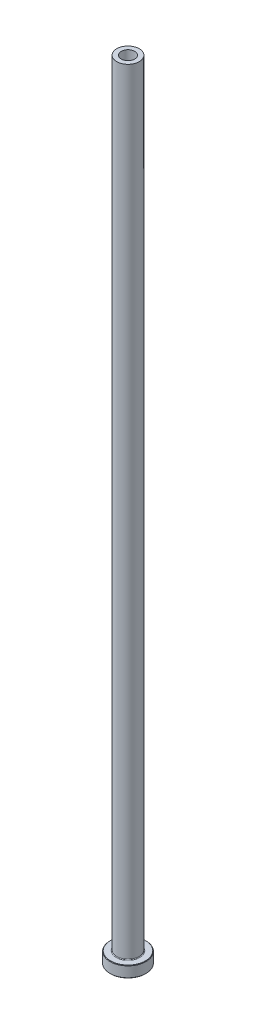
from build123d import *

# Parameters (mm, degrees)
FILLET1_R     = 0.3
CHAMFER1_SIZE = 0.2
CHAMFER3_SIZE = 0.5


with BuildPart() as part:
    # Sketch1 → Revolve1 (revolve)
    with BuildSketch(Plane.XY, mode=Mode.PRIVATE) as revolve1_sk:
        Polygon((-3, 350), (-5, 350), (-5, 5), (-8, 5), (-8, 0), (-3.25, 0), (-3.25, 293), (-3, 305), align=None)
    revolve(revolve1_sk.sketch.rotate(Axis((0, 92.187680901, 0), (0, -1, 0)), 270), axis=Axis((0, 92.187680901, 0), (0, -1, 0)))

    # Fillet1
    fillet1_edges = [part.edges().sort_by_distance(p)[0] for p in [
        (0, 5, -5),
    ]]
    fillet(fillet1_edges, radius=FILLET1_R)

    # Chamfer1
    chamfer1_edges = [part.edges().sort_by_distance(p)[0] for p in [
        (0, 0, -8),
        (0, 5, -8),
    ]]
    chamfer(chamfer1_edges, length=CHAMFER1_SIZE)

    # Chamfer3
    chamfer3_edges = [part.edges().sort_by_distance(p)[0] for p in [
        (0, 0, -3.25),
    ]]
    chamfer(chamfer3_edges, length=CHAMFER3_SIZE)


solid = part.part
